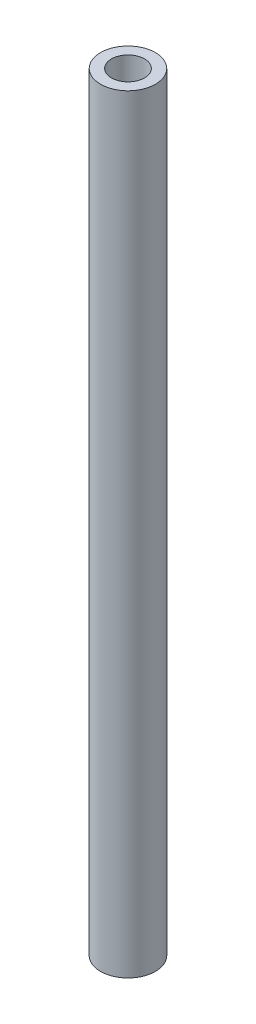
ISO-10303-21;
HEADER;
FILE_DESCRIPTION(('STEP AP214'),'2;1');
FILE_NAME('part.step','',(''),(''),'','','');
FILE_SCHEMA(('AUTOMOTIVE_DESIGN { 1 0 10303 214 1 1 1 1 }'));
ENDSEC;
DATA;
#1=APPLICATION_CONTEXT('core data for automotive mechanical design processes');
#2=APPLICATION_PROTOCOL_DEFINITION('international standard','automotive_design',2000,#1);
#3=PRODUCT_CONTEXT('',#1,'mechanical');
#4=PRODUCT('Part','Part','',(#3));
#5=PRODUCT_RELATED_PRODUCT_CATEGORY('part','',(#4));
#6=PRODUCT_DEFINITION_FORMATION('','',#4);
#7=PRODUCT_DEFINITION_CONTEXT('part definition',#1,'design');
#8=PRODUCT_DEFINITION('design','',#6,#7);
#9=PRODUCT_DEFINITION_SHAPE('','',#8);
#10=(LENGTH_UNIT() NAMED_UNIT(*) SI_UNIT(.MILLI.,.METRE.));
#11=(NAMED_UNIT(*) PLANE_ANGLE_UNIT() SI_UNIT($,.RADIAN.));
#12=(NAMED_UNIT(*) SI_UNIT($,.STERADIAN.) SOLID_ANGLE_UNIT());
#13=UNCERTAINTY_MEASURE_WITH_UNIT(LENGTH_MEASURE(1.E-05),#10,'distance_accuracy_value','');
#14=(GEOMETRIC_REPRESENTATION_CONTEXT(3) GLOBAL_UNCERTAINTY_ASSIGNED_CONTEXT((#13)) GLOBAL_UNIT_ASSIGNED_CONTEXT((#10,
#11,#12)) REPRESENTATION_CONTEXT('',''));
#15=CARTESIAN_POINT('',(0.,0.,0.));
#16=DIRECTION('',(0.,0.,1.));
#17=DIRECTION('',(1.,0.,0.));
#18=AXIS2_PLACEMENT_3D('',#15,#16,#17);
#19=CARTESIAN_POINT('',(0.,88.9,0.));
#20=DIRECTION('',(0.,1.,0.));
#21=DIRECTION('',(0.,0.,1.));
#22=AXIS2_PLACEMENT_3D('',#19,#20,#21);
#23=PLANE('',#22);
#24=CARTESIAN_POINT('',(0.,88.9,0.));
#25=DIRECTION('',(0.,1.,0.));
#26=DIRECTION('',(0.,0.,1.));
#27=AXIS2_PLACEMENT_3D('',#24,#25,#26);
#28=CIRCLE('',#27,3.175);
#29=CARTESIAN_POINT('',(0.,88.9,3.175));
#30=VERTEX_POINT('',#29);
#31=EDGE_CURVE('E10',#30,#30,#28,.T.);
#32=ORIENTED_EDGE('',*,*,#31,.T.);
#33=EDGE_LOOP('',(#32));
#34=FACE_BOUND('',#33,.T.);
#35=CARTESIAN_POINT('',(0.,88.9,0.));
#36=DIRECTION('',(0.,1.,0.));
#37=DIRECTION('',(0.,0.,1.));
#38=AXIS2_PLACEMENT_3D('',#35,#36,#37);
#39=CIRCLE('',#38,1.91264791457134);
#40=CARTESIAN_POINT('',(0.,88.9,1.91264791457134));
#41=VERTEX_POINT('',#40);
#42=EDGE_CURVE('E42',#41,#41,#39,.T.);
#43=ORIENTED_EDGE('',*,*,#42,.F.);
#44=EDGE_LOOP('',(#43));
#45=FACE_BOUND('',#44,.T.);
#46=ADVANCED_FACE('F31',(#34,#45),#23,.T.);
#47=CARTESIAN_POINT('',(0.,0.,0.));
#48=DIRECTION('',(0.,1.,0.));
#49=DIRECTION('',(0.,0.,1.));
#50=AXIS2_PLACEMENT_3D('',#47,#48,#49);
#51=PLANE('',#50);
#52=CARTESIAN_POINT('',(0.,0.,0.));
#53=DIRECTION('',(0.,1.,0.));
#54=DIRECTION('',(0.,0.,1.));
#55=AXIS2_PLACEMENT_3D('',#52,#53,#54);
#56=CIRCLE('',#55,3.175);
#57=CARTESIAN_POINT('',(0.,0.,3.175));
#58=VERTEX_POINT('',#57);
#59=EDGE_CURVE('E35',#58,#58,#56,.T.);
#60=ORIENTED_EDGE('',*,*,#59,.F.);
#61=EDGE_LOOP('',(#60));
#62=FACE_BOUND('',#61,.T.);
#63=CARTESIAN_POINT('',(0.,0.,0.));
#64=DIRECTION('',(0.,1.,0.));
#65=DIRECTION('',(0.,0.,1.));
#66=AXIS2_PLACEMENT_3D('',#63,#64,#65);
#67=CIRCLE('',#66,1.91264791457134);
#68=CARTESIAN_POINT('',(0.,0.,1.91264791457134));
#69=VERTEX_POINT('',#68);
#70=EDGE_CURVE('E44',#69,#69,#67,.T.);
#71=ORIENTED_EDGE('',*,*,#70,.T.);
#72=EDGE_LOOP('',(#71));
#73=FACE_BOUND('',#72,.T.);
#74=ADVANCED_FACE('F54',(#62,#73),#51,.F.);
#75=CARTESIAN_POINT('',(0.,88.9,0.));
#76=DIRECTION('',(0.,-1.,0.));
#77=DIRECTION('',(0.,0.,-1.));
#78=AXIS2_PLACEMENT_3D('',#75,#76,#77);
#79=CYLINDRICAL_SURFACE('',#78,3.175);
#80=ORIENTED_EDGE('',*,*,#31,.F.);
#81=EDGE_LOOP('',(#80));
#82=FACE_BOUND('',#81,.T.);
#83=ORIENTED_EDGE('',*,*,#59,.T.);
#84=EDGE_LOOP('',(#83));
#85=FACE_BOUND('',#84,.T.);
#86=ADVANCED_FACE('F33',(#82,#85),#79,.T.);
#87=CARTESIAN_POINT('',(0.,88.9,0.));
#88=DIRECTION('',(0.,-1.,0.));
#89=DIRECTION('',(0.,0.,-1.));
#90=AXIS2_PLACEMENT_3D('',#87,#88,#89);
#91=CYLINDRICAL_SURFACE('',#90,1.91264791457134);
#92=ORIENTED_EDGE('',*,*,#42,.T.);
#93=EDGE_LOOP('',(#92));
#94=FACE_BOUND('',#93,.T.);
#95=ORIENTED_EDGE('',*,*,#70,.F.);
#96=EDGE_LOOP('',(#95));
#97=FACE_BOUND('',#96,.T.);
#98=ADVANCED_FACE('F50',(#94,#97),#91,.F.);
#99=CLOSED_SHELL('',(#46,#74,#86,#98));
#100=MANIFOLD_SOLID_BREP('B2',#99);
#101=ADVANCED_BREP_SHAPE_REPRESENTATION('',(#18,#100),#14);
#102=SHAPE_DEFINITION_REPRESENTATION(#9,#101);
ENDSEC;
END-ISO-10303-21;
